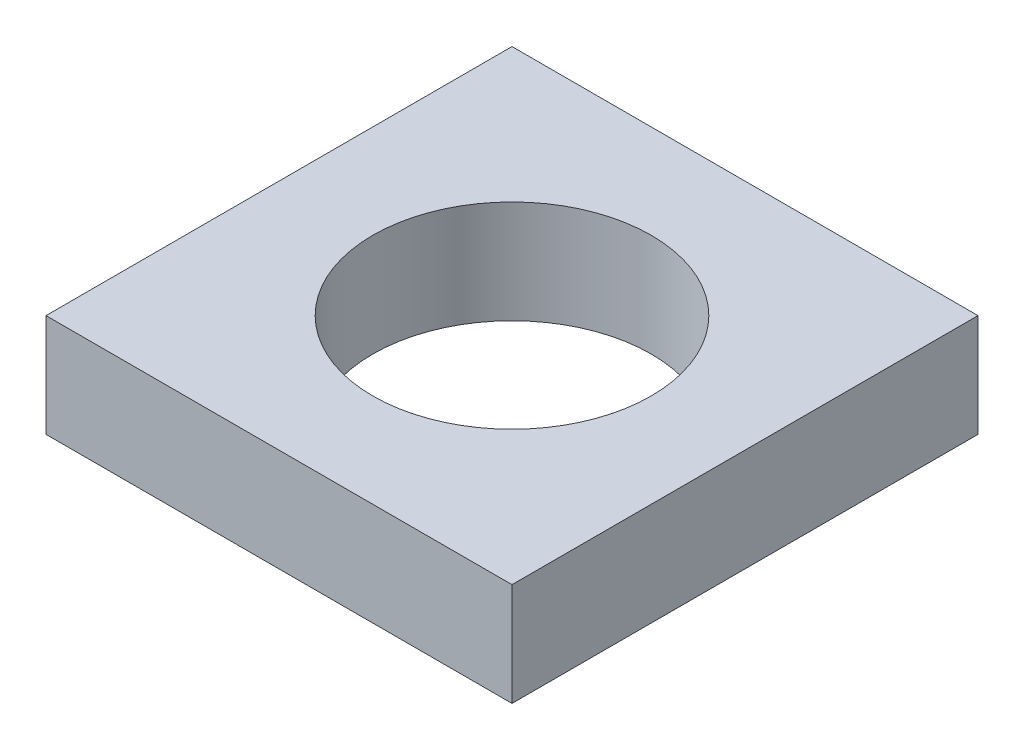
ISO-10303-21;
HEADER;
FILE_DESCRIPTION(('STEP AP214'),'2;1');
FILE_NAME('part.step','',(''),(''),'','','');
FILE_SCHEMA(('AUTOMOTIVE_DESIGN { 1 0 10303 214 1 1 1 1 }'));
ENDSEC;
DATA;
#1=APPLICATION_CONTEXT('core data for automotive mechanical design processes');
#2=APPLICATION_PROTOCOL_DEFINITION('international standard','automotive_design',2000,#1);
#3=PRODUCT_CONTEXT('',#1,'mechanical');
#4=PRODUCT('Part','Part','',(#3));
#5=PRODUCT_RELATED_PRODUCT_CATEGORY('part','',(#4));
#6=PRODUCT_DEFINITION_FORMATION('','',#4);
#7=PRODUCT_DEFINITION_CONTEXT('part definition',#1,'design');
#8=PRODUCT_DEFINITION('design','',#6,#7);
#9=PRODUCT_DEFINITION_SHAPE('','',#8);
#10=(LENGTH_UNIT() NAMED_UNIT(*) SI_UNIT(.MILLI.,.METRE.));
#11=(NAMED_UNIT(*) PLANE_ANGLE_UNIT() SI_UNIT($,.RADIAN.));
#12=(NAMED_UNIT(*) SI_UNIT($,.STERADIAN.) SOLID_ANGLE_UNIT());
#13=UNCERTAINTY_MEASURE_WITH_UNIT(LENGTH_MEASURE(1.E-05),#10,'distance_accuracy_value','');
#14=(GEOMETRIC_REPRESENTATION_CONTEXT(3) GLOBAL_UNCERTAINTY_ASSIGNED_CONTEXT((#13)) GLOBAL_UNIT_ASSIGNED_CONTEXT((#10,
#11,#12)) REPRESENTATION_CONTEXT('',''));
#15=CARTESIAN_POINT('',(0.,0.,0.));
#16=DIRECTION('',(0.,0.,1.));
#17=DIRECTION('',(1.,0.,0.));
#18=AXIS2_PLACEMENT_3D('',#15,#16,#17);
#19=CARTESIAN_POINT('',(4.8895,2.159,-4.8895));
#20=DIRECTION('',(-1.,0.,0.));
#21=DIRECTION('',(0.,0.,1.));
#22=AXIS2_PLACEMENT_3D('',#19,#20,#21);
#23=PLANE('',#22);
#24=DIRECTION('',(0.,0.,-1.));
#25=VECTOR('',#24,1.);
#26=CARTESIAN_POINT('',(4.8895,0.,-4.8895));
#27=LINE('',#26,#25);
#28=CARTESIAN_POINT('',(4.8895,0.,4.8895));
#29=VERTEX_POINT('',#28);
#30=CARTESIAN_POINT('',(4.8895,0.,-4.8895));
#31=VERTEX_POINT('',#30);
#32=EDGE_CURVE('E96',#29,#31,#27,.T.);
#33=ORIENTED_EDGE('',*,*,#32,.T.);
#34=DIRECTION('',(0.,-1.,0.));
#35=VECTOR('',#34,1.);
#36=CARTESIAN_POINT('',(4.8895,2.159,-4.8895));
#37=LINE('',#36,#35);
#38=CARTESIAN_POINT('',(4.8895,2.159,-4.8895));
#39=VERTEX_POINT('',#38);
#40=EDGE_CURVE('E11',#39,#31,#37,.T.);
#41=ORIENTED_EDGE('',*,*,#40,.F.);
#42=DIRECTION('',(0.,0.,-1.));
#43=VECTOR('',#42,1.);
#44=CARTESIAN_POINT('',(4.8895,2.159,-4.8895));
#45=LINE('',#44,#43);
#46=CARTESIAN_POINT('',(4.8895,2.159,4.8895));
#47=VERTEX_POINT('',#46);
#48=EDGE_CURVE('E84',#47,#39,#45,.T.);
#49=ORIENTED_EDGE('',*,*,#48,.F.);
#50=DIRECTION('',(0.,-1.,0.));
#51=VECTOR('',#50,1.);
#52=CARTESIAN_POINT('',(4.8895,2.159,4.8895));
#53=LINE('',#52,#51);
#54=EDGE_CURVE('E92',#47,#29,#53,.T.);
#55=ORIENTED_EDGE('',*,*,#54,.T.);
#56=EDGE_LOOP('',(#33,#41,#49,#55));
#57=FACE_BOUND('',#56,.T.);
#58=ADVANCED_FACE('F33',(#57),#23,.F.);
#59=CARTESIAN_POINT('',(-4.8895,2.159,-4.8895));
#60=DIRECTION('',(0.,0.,1.));
#61=DIRECTION('',(1.,0.,0.));
#62=AXIS2_PLACEMENT_3D('',#59,#60,#61);
#63=PLANE('',#62);
#64=DIRECTION('',(-1.,0.,0.));
#65=VECTOR('',#64,1.);
#66=CARTESIAN_POINT('',(-4.8895,0.,-4.8895));
#67=LINE('',#66,#65);
#68=CARTESIAN_POINT('',(-4.8895,0.,-4.8895));
#69=VERTEX_POINT('',#68);
#70=EDGE_CURVE('E88',#31,#69,#67,.T.);
#71=ORIENTED_EDGE('',*,*,#70,.T.);
#72=DIRECTION('',(0.,-1.,0.));
#73=VECTOR('',#72,1.);
#74=CARTESIAN_POINT('',(-4.8895,2.159,-4.8895));
#75=LINE('',#74,#73);
#76=CARTESIAN_POINT('',(-4.8895,2.159,-4.8895));
#77=VERTEX_POINT('',#76);
#78=EDGE_CURVE('E41',#77,#69,#75,.T.);
#79=ORIENTED_EDGE('',*,*,#78,.F.);
#80=DIRECTION('',(-1.,0.,0.));
#81=VECTOR('',#80,1.);
#82=CARTESIAN_POINT('',(-4.8895,2.159,-4.8895));
#83=LINE('',#82,#81);
#84=EDGE_CURVE('E79',#39,#77,#83,.T.);
#85=ORIENTED_EDGE('',*,*,#84,.F.);
#86=ORIENTED_EDGE('',*,*,#40,.T.);
#87=EDGE_LOOP('',(#71,#79,#85,#86));
#88=FACE_BOUND('',#87,.T.);
#89=ADVANCED_FACE('F87',(#88),#63,.F.);
#90=CARTESIAN_POINT('',(-4.8895,2.159,-4.8895));
#91=DIRECTION('',(1.,0.,0.));
#92=DIRECTION('',(0.,0.,-1.));
#93=AXIS2_PLACEMENT_3D('',#90,#91,#92);
#94=PLANE('',#93);
#95=DIRECTION('',(0.,0.,1.));
#96=VECTOR('',#95,1.);
#97=CARTESIAN_POINT('',(-4.8895,0.,-4.8895));
#98=LINE('',#97,#96);
#99=CARTESIAN_POINT('',(-4.8895,0.,4.8895));
#100=VERTEX_POINT('',#99);
#101=EDGE_CURVE('E66',#69,#100,#98,.T.);
#102=ORIENTED_EDGE('',*,*,#101,.T.);
#103=DIRECTION('',(0.,-1.,0.));
#104=VECTOR('',#103,1.);
#105=CARTESIAN_POINT('',(-4.8895,2.159,4.8895));
#106=LINE('',#105,#104);
#107=CARTESIAN_POINT('',(-4.8895,2.159,4.8895));
#108=VERTEX_POINT('',#107);
#109=EDGE_CURVE('E89',#108,#100,#106,.T.);
#110=ORIENTED_EDGE('',*,*,#109,.F.);
#111=DIRECTION('',(0.,0.,1.));
#112=VECTOR('',#111,1.);
#113=CARTESIAN_POINT('',(-4.8895,2.159,-4.8895));
#114=LINE('',#113,#112);
#115=EDGE_CURVE('E82',#77,#108,#114,.T.);
#116=ORIENTED_EDGE('',*,*,#115,.F.);
#117=ORIENTED_EDGE('',*,*,#78,.T.);
#118=EDGE_LOOP('',(#102,#110,#116,#117));
#119=FACE_BOUND('',#118,.T.);
#120=ADVANCED_FACE('F90',(#119),#94,.F.);
#121=CARTESIAN_POINT('',(-4.8895,2.159,4.8895));
#122=DIRECTION('',(0.,0.,-1.));
#123=DIRECTION('',(-1.,0.,0.));
#124=AXIS2_PLACEMENT_3D('',#121,#122,#123);
#125=PLANE('',#124);
#126=DIRECTION('',(1.,0.,0.));
#127=VECTOR('',#126,1.);
#128=CARTESIAN_POINT('',(-4.8895,0.,4.8895));
#129=LINE('',#128,#127);
#130=EDGE_CURVE('E72',#100,#29,#129,.T.);
#131=ORIENTED_EDGE('',*,*,#130,.T.);
#132=ORIENTED_EDGE('',*,*,#54,.F.);
#133=DIRECTION('',(1.,0.,0.));
#134=VECTOR('',#133,1.);
#135=CARTESIAN_POINT('',(-4.8895,2.159,4.8895));
#136=LINE('',#135,#134);
#137=EDGE_CURVE('E49',#108,#47,#136,.T.);
#138=ORIENTED_EDGE('',*,*,#137,.F.);
#139=ORIENTED_EDGE('',*,*,#109,.T.);
#140=EDGE_LOOP('',(#131,#132,#138,#139));
#141=FACE_BOUND('',#140,.T.);
#142=ADVANCED_FACE('F104',(#141),#125,.F.);
#143=CARTESIAN_POINT('',(0.,2.159,0.));
#144=DIRECTION('',(0.,1.,0.));
#145=DIRECTION('',(0.,0.,1.));
#146=AXIS2_PLACEMENT_3D('',#143,#144,#145);
#147=PLANE('',#146);
#148=CARTESIAN_POINT('',(0.,2.159,0.));
#149=DIRECTION('',(0.,1.,0.));
#150=DIRECTION('',(0.,0.,1.));
#151=AXIS2_PLACEMENT_3D('',#148,#149,#150);
#152=CIRCLE('',#151,2.921);
#153=CARTESIAN_POINT('',(0.,2.159,2.921));
#154=VERTEX_POINT('',#153);
#155=EDGE_CURVE('E110',#154,#154,#152,.T.);
#156=ORIENTED_EDGE('',*,*,#155,.F.);
#157=EDGE_LOOP('',(#156));
#158=FACE_BOUND('',#157,.T.);
#159=ORIENTED_EDGE('',*,*,#48,.T.);
#160=ORIENTED_EDGE('',*,*,#84,.T.);
#161=ORIENTED_EDGE('',*,*,#115,.T.);
#162=ORIENTED_EDGE('',*,*,#137,.T.);
#163=EDGE_LOOP('',(#159,#160,#161,#162));
#164=FACE_BOUND('',#163,.T.);
#165=ADVANCED_FACE('F80',(#158,#164),#147,.T.);
#166=CARTESIAN_POINT('',(0.,0.,0.));
#167=DIRECTION('',(0.,1.,0.));
#168=DIRECTION('',(0.,0.,1.));
#169=AXIS2_PLACEMENT_3D('',#166,#167,#168);
#170=PLANE('',#169);
#171=CARTESIAN_POINT('',(0.,0.,0.));
#172=DIRECTION('',(0.,1.,0.));
#173=DIRECTION('',(0.,0.,1.));
#174=AXIS2_PLACEMENT_3D('',#171,#172,#173);
#175=CIRCLE('',#174,2.921);
#176=CARTESIAN_POINT('',(0.,0.,2.921));
#177=VERTEX_POINT('',#176);
#178=EDGE_CURVE('E99',#177,#177,#175,.T.);
#179=ORIENTED_EDGE('',*,*,#178,.T.);
#180=EDGE_LOOP('',(#179));
#181=FACE_BOUND('',#180,.T.);
#182=ORIENTED_EDGE('',*,*,#32,.F.);
#183=ORIENTED_EDGE('',*,*,#130,.F.);
#184=ORIENTED_EDGE('',*,*,#101,.F.);
#185=ORIENTED_EDGE('',*,*,#70,.F.);
#186=EDGE_LOOP('',(#182,#183,#184,#185));
#187=FACE_BOUND('',#186,.T.);
#188=ADVANCED_FACE('F107',(#181,#187),#170,.F.);
#189=CARTESIAN_POINT('',(0.,0.,0.));
#190=DIRECTION('',(0.,1.,0.));
#191=DIRECTION('',(0.,0.,1.));
#192=AXIS2_PLACEMENT_3D('',#189,#190,#191);
#193=CYLINDRICAL_SURFACE('',#192,2.921);
#194=ORIENTED_EDGE('',*,*,#178,.F.);
#195=EDGE_LOOP('',(#194));
#196=FACE_BOUND('',#195,.T.);
#197=ORIENTED_EDGE('',*,*,#155,.T.);
#198=EDGE_LOOP('',(#197));
#199=FACE_BOUND('',#198,.T.);
#200=ADVANCED_FACE('F117',(#196,#199),#193,.F.);
#201=CLOSED_SHELL('',(#58,#89,#120,#142,#165,#188,#200));
#202=MANIFOLD_SOLID_BREP('B2',#201);
#203=ADVANCED_BREP_SHAPE_REPRESENTATION('',(#18,#202),#14);
#204=SHAPE_DEFINITION_REPRESENTATION(#9,#203);
ENDSEC;
END-ISO-10303-21;
